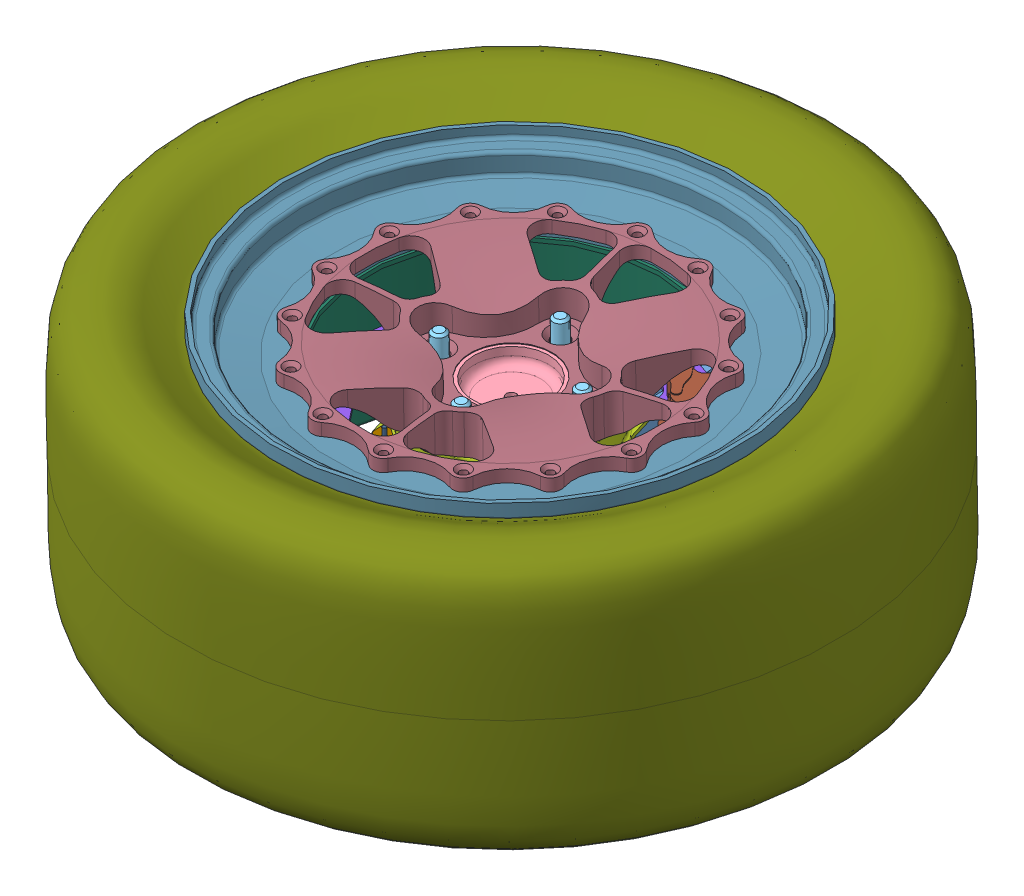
SolidWorks assembly Unspring Mass Assembly - Right_Final.SLDASM, configuration Default (file format 13000). Lengths in mm.
Overall size (655.6 219.09 659.13).
49 component instances, 16 part files, 11 mates.
Components (placement in the parent):
- Upright Assembly - Mirror_Final-3: Upright Assembly - Mirror_Final.SLDASM [Default] at (1.0276 15.994 17.5776) size (187.69 75.94 260.67)
  - Upright - Mirror_Final-1: Upright - Mirror_Final.SLDPRT [AP Caliper] at (-28.1936 -601.3602 -253.5794) size (187.69 75.94 260.67)
  - Oil Seal_Final-1: Oil Seal_Final.SLDPRT [Default] at (-28.1936 8.8942 0.8085) x (0 -0.999848 -0.017452) z (-0.156462 -0.017237 0.987534) size (6.35 67.59 67.59)
  - Oil Seal_Final-2: Oil Seal_Final.SLDPRT [Default] at (-28.1936 -47.6122 -0.1778) x (0 0.999848 0.017452) z (-0.017452 -0.01745 0.999695) size (6.35 67.59 67.59)
  - Tapered Roller Bearing_Final-1: Tapered Roller Bearing_Final.SLDPRT [Default] at (-28.1936 -26.0254 0.199) x (0 -0.999848 -0.017452) z (0.934797 -0.006199 0.355129) size (17 55 55)
  - Tapered Roller Bearing_Final-2: Tapered Roller Bearing_Final.SLDPRT [Default] at (-28.1936 -15.7273 0.3787) x (0 0.999848 0.017452) z (0.612483 -0.013796 0.790364) size (17 55 55)
- Hub Assembly_Final-1: Hub Assembly_Final.SLDASM [Default] at (-27.166 37.2635 18.6021) x (0 0.999848 0.017452) z (0.568776 0.014354 -0.822367) size (81.66 92.75 92.75)
  - Hub - Aluminum_Final-1: Hub - Aluminum_Final.SLDPRT [SPLIT LINES] at (-63.5 0 0) size (68.33 92.75 92.75)
  - Wheel Stud_Final-1: Wheel Stud_Final.SLDPRT [LUG NUT CUT DOWN] at (-15.24 -33.676 33.676) x (1 0 0) z (0 0.091677 0.995789) size (41.27 15.88 15.88)
  - Wheel Stud_Final-2: Wheel Stud_Final.SLDPRT [LUG NUT CUT DOWN] at (-15.24 33.676 33.676) x (1 0 0) z (0 0.995789 -0.091677) size (41.27 15.88 15.88)
  - Wheel Stud_Final-3: Wheel Stud_Final.SLDPRT [LUG NUT CUT DOWN] at (-15.24 33.676 -33.676) x (1 0 0) z (0 -0.091677 -0.995789) size (41.27 15.88 15.88)
  - Wheel Stud_Final-4: Wheel Stud_Final.SLDPRT [LUG NUT CUT DOWN] at (-15.24 -33.676 -33.676) x (1 0 0) z (0 -0.995789 0.091677) size (41.27 15.88 15.88)
  - Hub Washer_Final-1: Hub Washer_Final.SLDPRT [NO_SPLITLINE] at (-20.0025 0 0) x (1 0 0) z (0 0.089607 0.995977) size (11.11 57.71 57.71)
- Brake Rotor Assembly_Final-1: Brake Rotor Assembly_Final.SLDASM [Default] at (3.214 50.726 15.9378) x (0 0.999848 0.017452) z (0.179405 -0.017169 0.983625) size (25.91 327.78 327.78)
  - Rotor Hat_Final-1: Rotor Hat_Final.SLDPRT [Default] at (-34.2242 30.4071 -2.5985) size (23.6 152.4 152.4)
  - Rotor - Cast Iron_Final-1: Rotor - Cast Iron_Final.SLDPRT [Default] at (-31.2397 30.4071 -2.5985) x (0 0.707107 0.707107) z (-1 0 0) size (231.78 231.78 3.17)
  - Rotor Washer_Final-1: Rotor Washer_Final.SLDPRT [Default] at (-31.2397 33.0101 -12.653) x (0 0.99948 0.032253) z (1 0 0) size (18.57 10.78 1.59)
  - Rotor Washer_Final-27: Rotor Washer_Final.SLDPRT [Chamfer] at (-34.4147 41.3596 -11.9484) x (0 -0.990749 -0.135705) z (-1 0 0) size (18.57 10.78 1.59)
  - Rotor Pin_Final-6: Rotor Pin_Final.SLDPRT [.5] at (-34.9647 30.4071 68.0135) x (0 0.996402 -0.084747) z (-1 0 0) size (6.36 6.36 12.79)
  - Rotor Washer_Final-13: Rotor Washer_Final.SLDPRT [Default] at (-31.2397 25.1381 -11.5488) x (0 0.729545 -0.683933) z (1 0 0) size (18.57 10.78 1.59)
  - Rotor Washer_Final-14: Rotor Washer_Final.SLDPRT [Default] at (-31.2397 20.3526 -5.2016) x (0 0.032253 -0.99948) z (1 0 0) size (18.57 10.78 1.59)
  - Rotor Washer_Final-15: Rotor Washer_Final.SLDPRT [Default] at (-31.2397 21.4568 2.6705) x (0 -0.683933 -0.729545) z (1 0 0) size (18.57 10.78 1.59)
  - Rotor Washer_Final-16: Rotor Washer_Final.SLDPRT [Default] at (-31.2397 27.804 7.456) x (0 -0.99948 -0.032253) z (1 0 0) size (18.57 10.78 1.59)
  - Rotor Washer_Final-17: Rotor Washer_Final.SLDPRT [Default] at (-31.2397 35.676 6.3518) x (0 -0.729545 0.683933) z (1 0 0) size (18.57 10.78 1.59)
  - Rotor Pin_Final-7: Rotor Pin_Final.SLDPRT [.5] at (-34.9647 80.3373 47.3317) x (0 0.644638 -0.764488) z (-1 0 0) size (6.36 6.36 12.79)
  - Rotor Pin_Final-8: Rotor Pin_Final.SLDPRT [.5] at (-34.9647 101.0191 -2.5985) x (0 -0.084747 -0.996402) z (-1 0 0) size (6.36 6.36 12.79)
  - Rotor Pin_Final-9: Rotor Pin_Final.SLDPRT [.5] at (-34.9647 80.3373 -52.5287) x (0 -0.764488 -0.644638) z (-1 0 0) size (6.36 6.36 12.79)
  - Rotor Pin_Final-10: Rotor Pin_Final.SLDPRT [.5] at (-34.9647 30.4071 -73.2105) x (0 -0.996402 0.084747) z (-1 0 0) size (6.36 6.36 12.79)
  - Rotor Pin_Final-11: Rotor Pin_Final.SLDPRT [.5] at (-34.9647 -19.5231 -52.5287) x (0 -0.644638 0.764488) z (-1 0 0) size (6.36 6.36 12.79)
  - Rotor Pin_Final-12: Rotor Pin_Final.SLDPRT [.5] at (-34.9647 -40.2049 -2.5985) x (0 0.084747 0.996402) z (-1 0 0) size (6.36 6.36 12.79)
  - Rotor Pin_Final-13: Rotor Pin_Final.SLDPRT [.5] at (-34.9647 -19.5231 47.3317) x (0 0.764488 0.644638) z (-1 0 0) size (6.36 6.36 12.79)
  - Rotor Washer_Final-25: Rotor Washer_Final.SLDPRT [Default] at (-31.2397 40.4616 0.0046) x (0 -0.032253 0.99948) z (1 0 0) size (18.57 10.78 1.59)
  - Rotor Washer_Final-26: Rotor Washer_Final.SLDPRT [Default] at (-31.2397 39.3573 -7.8675) x (0 0.683933 0.729545) z (1 0 0) size (18.57 10.78 1.59)
  - Rotor Washer_Final-28: Rotor Washer_Final.SLDPRT [Chamfer] at (-34.4147 31.5403 -16.9545) x (0 -0.796524 0.604608) z (-1 0 0) size (18.57 10.78 1.59)
  - Rotor Washer_Final-29: Rotor Washer_Final.SLDPRT [Chamfer] at (-34.4147 21.0572 -13.551) x (0 -0.135705 0.990749) z (-1 0 0) size (18.57 10.78 1.59)
  - Rotor Washer_Final-30: Rotor Washer_Final.SLDPRT [Chamfer] at (-34.4147 16.0511 -3.7317) x (0 0.604608 0.796524) z (-1 0 0) size (18.57 10.78 1.59)
  - Rotor Washer_Final-31: Rotor Washer_Final.SLDPRT [Chamfer] at (-34.4147 19.4545 6.7514) x (0 0.990749 0.135705) z (-1 0 0) size (18.57 10.78 1.59)
  - Rotor Washer_Final-32: Rotor Washer_Final.SLDPRT [Chamfer] at (-34.4147 29.2738 11.7575) x (0 0.796524 -0.604608) z (-1 0 0) size (18.57 10.78 1.59)
  - Rotor Washer_Final-33: Rotor Washer_Final.SLDPRT [Chamfer] at (-34.4147 39.757 8.3541) x (0 0.135705 -0.990749) z (-1 0 0) size (18.57 10.78 1.59)
  - Rotor Washer_Final-34: Rotor Washer_Final.SLDPRT [Chamfer] at (-34.4147 44.7631 -1.4652) x (0 -0.604608 -0.796524) z (-1 0 0) size (18.57 10.78 1.59)
- Brake Caliper Assembly_Final-1: Brake Caliper Assembly_Final.SLDASM [Default] at (73.5704 19.2772 -63.2993) x (-0.62932 0.013563 -0.777028) z (0 -0.999848 -0.017452) size (81.53 53.21 65.79)
  - Brake Caliper_Final-2: Brake Caliper_Final.SLDPRT [Default] at origin size (81.53 52.96 65.79)
  - Brake Pad_Final-1: Brake Pad_Final.SLDPRT [Default] at (0 -13.1318 -7.3025) size (39.75 43.48 7.11)
  - Brake Pad_Final-2: Brake Pad_Final.SLDPRT [Default] at (0 -13.1318 7.3025) x (-1 0 0) z (0 0 -1) size (39.75 43.48 7.11)
- Wheel Assembly_Final-1: Wheel Assembly_Final.SLDASM [Default] at (-27.166 65.4533 19.0941) x (0.983775 0.003131 -0.179378) z (0 0.999848 0.017452) size (563.63 563.63 207.68)
  - Wheel Center - Aluminum_Final-1: Wheel Center - Aluminum_Final.SLDPRT [Default] at origin size (260.35 260.35 36.14)
  - Wheel Shell - Outer_Final-1: Wheel Shell - Outer_Final.SLDPRT [Default] at (0 0 -3.175) x (0 0 1) z (-0.92388 -0.382683 0) size (31.75 355.6 355.6)
  - Wheel Shell - Inner_Final-1: Wheel Shell - Inner_Final.SLDPRT [Default] at (0 0 -3.175) x (0 0 1) z (-0.707107 -0.707107 0) size (151 355.6 355.6)
  - Tire_Final-1: Tire_Final.SLDPRT [Default] at (0 0 -62.8015) x (0 0 -1) z (0.993511 0.113735 0) size (207.68 509.04 509.04)
Mates (geometry in assembly coordinates):
- Concentric3: concentric anti-aligned: cylinder of Upright Assembly - Mirror_Final-3/Tapered Roller Bearing_Final-2 through (-27.166 0.2667 17.9563) axis (0 -0.999848 -0.017452) radius 15; cylinder of Hub Assembly_Final-1/Hub - Aluminum_Final-1 through (-27.166 183.3399 21.1519) axis (0 0.999848 0.017452) radius 15
- Coincident2: coincident anti-aligned: plane of Upright Assembly - Mirror_Final-3/Tapered Roller Bearing_Final-2 through (-42.5804 17.0556 30.1946) normal (0 0.999848 0.017452); plane of Hub Assembly_Final-1/Hub Washer_Final-1 through (-15.6427 17.0965 27.8544) normal (0 -0.999848 -0.017452)
- Coincident3: coincident anti-aligned: plane of Hub Assembly_Final-1/Hub - Aluminum_Final-1 through (25.0623 36.6332 54.7139) normal (0 0.999848 0.017452); plane of Brake Rotor Assembly_Final-1/Rotor Hat_Final-1 through (-60.7394 37.1567 24.7237) normal (0 -0.999848 -0.017452)
- Concentric9: concentric anti-aligned: cylinder of Hub Assembly_Final-1/Hub - Aluminum_Final-1 through (-27.166 -72.7366 16.682) axis (0 -0.999848 -0.017452) radius 31.75; cylinder of Wheel Assembly_Final-1/Wheel Center - Aluminum_Final-1 through (-27.166 40.0571 18.6509) axis (0 0.999848 0.017452) radius 31.75
- Coincident6: coincident anti-aligned: plane of Brake Rotor Assembly_Final-1/Rotor Hat_Final-1 through (-87.012 39.8666 29.5629) normal (0 0.999848 0.017452); plane of Wheel Assembly_Final-1/Wheel Center - Aluminum_Final-1 through (-27.166 40.0571 18.6509) normal (0 -0.999848 -0.017452)
- Concentric10: concentric anti-aligned: cylinder of Hub Assembly_Final-1/Wheel Stud_Final-3 through (-18.6218 -25.647 64.3634) axis (0 -0.999848 -0.017452) radius 5.5563; cylinder of Wheel Assembly_Final-1/Wheel Center - Aluminum_Final-1 through (-18.6218 39.2394 65.496) axis (0 0.999848 0.017452) radius 6.35
- Concentric11: concentric anti-aligned: cylinder of Hub Assembly_Final-1/Hub - Aluminum_Final-1 through (-27.166 -72.7366 16.682) axis (0 -0.999848 -0.017452) radius 31.75; cylinder of Brake Rotor Assembly_Final-1/Rotor Hat_Final-1 through (-27.166 42.3225 18.6904) axis (0 0.999848 0.017452) radius 31.877
- Concentric12: concentric anti-aligned: cylinder of Hub Assembly_Final-1/Wheel Stud_Final-1 through (-35.7101 -24.0116 -29.3269) axis (0 -0.999848 -0.017452) radius 5.5563; cylinder of Brake Rotor Assembly_Final-1/Rotor Hat_Final-1 through (-35.7101 17.2732 -28.6063) axis (0 0.999848 0.017452) radius 5.5245
- Concentric13: concentric anti-aligned: cylinder of Upright Assembly - Mirror_Final-3/Upright - Mirror_Final-1 through (58.7503 -42.8901 -11.1983) axis (0 0.999848 0.017452) radius 4.0005; cylinder of Brake Caliper Assembly_Final-1/Brake Caliper_Final-2 through (58.75 -8.266 -10.5943) axis (0 -0.999848 -0.017452) radius 4
- Concentric14: concentric anti-aligned: cylinder of Upright Assembly - Mirror_Final-3/Upright - Mirror_Final-1 through (18.4735 -42.0221 -60.9284) axis (0 0.999848 0.017452) radius 4.0005; cylinder of Brake Caliper Assembly_Final-1/Brake Caliper_Final-2 through (18.4735 -7.398 -60.324) axis (0 -0.999848 -0.017452) radius 4
- Coincident7: coincident anti-aligned: plane of Upright Assembly - Mirror_Final-3/Upright - Mirror_Final-1 through (34.4967 -8.6751 12.8429) normal (0 0.999848 0.017452); plane of Brake Caliper Assembly_Final-1/Brake Caliper_Final-2 through (18.4735 -7.398 -60.324) normal (0 -0.999848 -0.017452)
